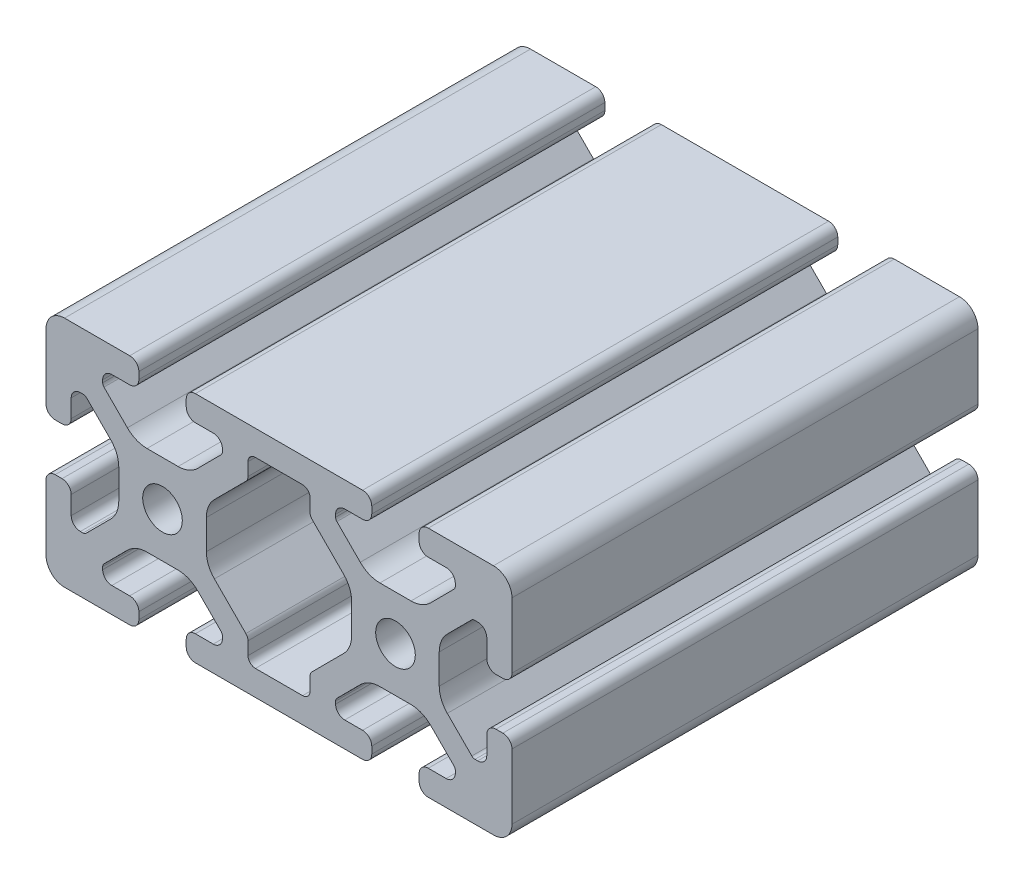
from build123d import *

# Parameters (mm, degrees)
SKETCH1_R      = 3.4
EXTRUDE1_DEPTH = 40


with BuildPart() as part:
    # Sketch1 → Extrude1 (new, symmetric)
    with BuildSketch(Plane.XY):
        with BuildLine():
            Line((15.924472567, -18.442200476), (15.924472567, -17.254670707))
            ThreePointArc((15.924472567, -17.254670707), (15.464630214, -16.14451306), (14.354472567, -15.684670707))
            Line((14.354472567, -15.684670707), (11.285535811, -15.684670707))
            ThreePointArc((11.285535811, -15.684670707), (10.175378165, -15.224828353), (9.715535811, -14.114670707))
            Line((9.715535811, -14.114670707), (9.715535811, -13.671864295))
            ThreePointArc((9.715535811, -13.671864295), (9.773099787, -13.381720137), (9.937071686, -13.13552822))
            Line((9.937071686, -13.13552822), (13.95542212, -9.10123395))
            ThreePointArc((13.95542212, -9.10123395), (15.498733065, -8.06670831), (17.320822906, -7.703334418))
            Line((17.320822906, -7.703334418), (22.66210189, -7.703334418))
            ThreePointArc((22.66210189, -7.703334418), (24.484191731, -8.06670831), (26.027502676, -9.10123395))
            Line((26.027502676, -9.10123395), (30.045853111, -13.13552822))
            ThreePointArc((30.045853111, -13.13552822), (30.209825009, -13.381720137), (30.267388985, -13.671864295))
            Line((30.267388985, -13.671864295), (30.267388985, -14.114670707))
            ThreePointArc((30.267388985, -14.114670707), (29.807546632, -15.224828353), (28.697388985, -15.684670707))
            Line((28.697388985, -15.684670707), (25.628452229, -15.684670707))
            ThreePointArc((25.628452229, -15.684670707), (24.518294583, -16.14451306), (24.058452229, -17.254670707))
            Line((24.058452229, -17.254670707), (24.058452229, -18.442200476))
            ThreePointArc((24.058452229, -18.442200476), (24.518294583, -19.552358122), (25.628452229, -20.012200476))
            Line((25.628452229, -20.012200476), (36.819087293, -20.012200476))
            ThreePointArc((36.819087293, -20.012200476), (39.067686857, -19.08080004), (39.999087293, -16.832200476))
            Line((39.999087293, -16.832200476), (39.999087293, -5.641565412))
            ThreePointArc((39.999087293, -5.641565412), (39.53924494, -4.531407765), (38.429087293, -4.071565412))
            Line((38.429087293, -4.071565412), (37.241557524, -4.071565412))
            ThreePointArc((37.241557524, -4.071565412), (36.131399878, -4.531407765), (35.671557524, -5.641565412))
            Line((35.671557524, -5.641565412), (35.671557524, -8.781441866))
            ThreePointArc((35.671557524, -8.781441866), (35.211715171, -9.891599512), (34.101557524, -10.351441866))
            Line((34.101557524, -10.351441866), (33.646201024, -10.351441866))
            ThreePointArc((33.646201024, -10.351441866), (33.35466665, -10.293302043), (33.107736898, -10.127777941))
            Line((33.107736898, -10.127777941), (28.893335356, -5.89665468))
            ThreePointArc((28.893335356, -5.89665468), (27.868510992, -4.357955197), (27.508736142, -2.544554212))
            Line((27.508736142, -2.544554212), (27.508736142, 2.543848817))
            ThreePointArc((27.508736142, 2.543848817), (27.868510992, 4.357249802), (28.893335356, 5.895949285))
            Line((28.893335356, 5.895949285), (33.049907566, 10.069013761))
            ThreePointArc((33.049907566, 10.069013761), (33.296837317, 10.234537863), (33.588371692, 10.292677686))
            Line((33.588371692, 10.292677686), (34.101557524, 10.292677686))
            ThreePointArc((34.101557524, 10.292677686), (35.211715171, 9.832835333), (35.671557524, 8.722677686))
            Line((35.671557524, 8.722677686), (35.671557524, 5.640860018))
            ThreePointArc((35.671557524, 5.640860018), (36.131399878, 4.530702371), (37.241557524, 4.070860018))
            Line((37.241557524, 4.070860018), (38.429087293, 4.070860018))
            ThreePointArc((38.429087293, 4.070860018), (39.53924494, 4.530702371), (39.999087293, 5.640860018))
            Line((39.999087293, 5.640860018), (39.999087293, 16.831495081))
            ThreePointArc((39.999087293, 16.831495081), (39.067686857, 19.080094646), (36.819087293, 20.011495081))
            Line((36.819087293, 20.011495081), (25.628452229, 20.011495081))
            ThreePointArc((25.628452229, 20.011495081), (24.518294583, 19.551652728), (24.058452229, 18.441495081))
            Line((24.058452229, 18.441495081), (24.058452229, 17.253965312))
            ThreePointArc((24.058452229, 17.253965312), (24.518294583, 16.143807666), (25.628452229, 15.683965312))
            Line((25.628452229, 15.683965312), (28.697388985, 15.683965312))
            ThreePointArc((28.697388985, 15.683965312), (29.807546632, 15.224122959), (30.267388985, 14.113965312))
            Line((30.267388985, 14.113965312), (30.267388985, 13.671158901))
            ThreePointArc((30.267388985, 13.671158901), (30.209825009, 13.381014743), (30.045853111, 13.134822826))
            Line((30.045853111, 13.134822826), (26.027502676, 9.100528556))
            ThreePointArc((26.027502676, 9.100528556), (24.484191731, 8.066002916), (22.66210189, 7.702629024))
            Line((22.66210189, 7.702629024), (17.320822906, 7.702629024))
            ThreePointArc((17.320822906, 7.702629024), (15.498733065, 8.066002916), (13.95542212, 9.100528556))
            Line((13.95542212, 9.100528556), (9.937071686, 13.134822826))
            ThreePointArc((9.937071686, 13.134822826), (9.773099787, 13.381014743), (9.715535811, 13.671158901))
            Line((9.715535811, 13.671158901), (9.715535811, 14.113965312))
            ThreePointArc((9.715535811, 14.113965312), (10.175378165, 15.224122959), (11.285535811, 15.683965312))
            Line((11.285535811, 15.683965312), (14.354472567, 15.683965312))
            ThreePointArc((14.354472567, 15.683965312), (15.464630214, 16.143807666), (15.924472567, 17.253965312))
            Line((15.924472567, 17.253965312), (15.924472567, 18.441495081))
            ThreePointArc((15.924472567, 18.441495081), (15.464630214, 19.551652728), (14.354472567, 20.011495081))
            Line((14.354472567, 20.011495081), (-14.354482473, 20.011495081))
            ThreePointArc((-14.354482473, 20.011495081), (-15.464640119, 19.551652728), (-15.924482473, 18.441495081))
            Line((-15.924482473, 18.441495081), (-15.924482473, 17.253965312))
            ThreePointArc((-15.924482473, 17.253965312), (-15.464640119, 16.143807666), (-14.354482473, 15.683965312))
            Line((-14.354482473, 15.683965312), (-11.285545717, 15.683965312))
            ThreePointArc((-11.285545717, 15.683965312), (-10.17538807, 15.224122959), (-9.715545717, 14.113965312))
            Line((-9.715545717, 14.113965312), (-9.715545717, 13.671158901))
            ThreePointArc((-9.715545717, 13.671158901), (-9.773109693, 13.381014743), (-9.937081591, 13.134822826))
            Line((-9.937081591, 13.134822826), (-13.955432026, 9.100528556))
            ThreePointArc((-13.955432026, 9.100528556), (-15.498742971, 8.066002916), (-17.320832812, 7.702629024))
            Line((-17.320832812, 7.702629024), (-22.662111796, 7.702629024))
            ThreePointArc((-22.662111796, 7.702629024), (-24.484201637, 8.066002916), (-26.027512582, 9.100528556))
            Line((-26.027512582, 9.100528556), (-30.045863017, 13.134822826))
            ThreePointArc((-30.045863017, 13.134822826), (-30.209834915, 13.381014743), (-30.267398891, 13.671158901))
            Line((-30.267398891, 13.671158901), (-30.267398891, 14.113965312))
            ThreePointArc((-30.267398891, 14.113965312), (-29.807556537, 15.224122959), (-28.697398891, 15.683965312))
            Line((-28.697398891, 15.683965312), (-25.628462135, 15.683965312))
            ThreePointArc((-25.628462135, 15.683965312), (-24.518304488, 16.143807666), (-24.058462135, 17.253965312))
            Line((-24.058462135, 17.253965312), (-24.058462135, 18.441495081))
            ThreePointArc((-24.058462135, 18.441495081), (-24.518304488, 19.551652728), (-25.628462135, 20.011495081))
            Line((-25.628462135, 20.011495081), (-36.819097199, 20.011495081))
            ThreePointArc((-36.819097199, 20.011495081), (-39.067696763, 19.080094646), (-39.999097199, 16.831495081))
            Line((-39.999097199, 16.831495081), (-39.999097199, 5.640860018))
            ThreePointArc((-39.999097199, 5.640860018), (-39.539254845, 4.530702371), (-38.429097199, 4.070860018))
            Line((-38.429097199, 4.070860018), (-37.24156743, 4.070860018))
            ThreePointArc((-37.24156743, 4.070860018), (-36.131409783, 4.530702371), (-35.67156743, 5.640860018))
            Line((-35.67156743, 5.640860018), (-35.67156743, 8.722677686))
            ThreePointArc((-35.67156743, 8.722677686), (-35.211725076, 9.832835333), (-34.10156743, 10.292677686))
            Line((-34.10156743, 10.292677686), (-33.588381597, 10.292677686))
            ThreePointArc((-33.588381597, 10.292677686), (-33.296847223, 10.234537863), (-33.049917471, 10.069013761))
            Line((-33.049917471, 10.069013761), (-28.893345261, 5.895949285))
            ThreePointArc((-28.893345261, 5.895949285), (-27.868520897, 4.357249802), (-27.508746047, 2.543848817))
            Line((-27.508746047, 2.543848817), (-27.508746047, -2.544554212))
            ThreePointArc((-27.508746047, -2.544554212), (-27.868520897, -4.357955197), (-28.893345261, -5.89665468))
            Line((-28.893345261, -5.89665468), (-33.107746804, -10.127777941))
            ThreePointArc((-33.107746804, -10.127777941), (-33.354676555, -10.293302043), (-33.64621093, -10.351441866))
            Line((-33.64621093, -10.351441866), (-34.10156743, -10.351441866))
            ThreePointArc((-34.10156743, -10.351441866), (-35.211725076, -9.891599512), (-35.67156743, -8.781441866))
            Line((-35.67156743, -8.781441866), (-35.67156743, -5.641565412))
            ThreePointArc((-35.67156743, -5.641565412), (-36.131409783, -4.531407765), (-37.24156743, -4.071565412))
            Line((-37.24156743, -4.071565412), (-38.429097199, -4.071565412))
            ThreePointArc((-38.429097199, -4.071565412), (-39.539254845, -4.531407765), (-39.999097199, -5.641565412))
            Line((-39.999097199, -5.641565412), (-39.999097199, -16.832200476))
            ThreePointArc((-39.999097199, -16.832200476), (-39.067696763, -19.08080004), (-36.819097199, -20.012200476))
            Line((-36.819097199, -20.012200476), (-25.628462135, -20.012200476))
            ThreePointArc((-25.628462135, -20.012200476), (-24.518304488, -19.552358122), (-24.058462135, -18.442200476))
            Line((-24.058462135, -18.442200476), (-24.058462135, -17.254670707))
            ThreePointArc((-24.058462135, -17.254670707), (-24.518304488, -16.14451306), (-25.628462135, -15.684670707))
            Line((-25.628462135, -15.684670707), (-28.697398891, -15.684670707))
            ThreePointArc((-28.697398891, -15.684670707), (-29.807556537, -15.224828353), (-30.267398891, -14.114670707))
            Line((-30.267398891, -14.114670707), (-30.267398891, -13.671864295))
            ThreePointArc((-30.267398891, -13.671864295), (-30.209834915, -13.381720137), (-30.045863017, -13.13552822))
            Line((-30.045863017, -13.13552822), (-26.027512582, -9.10123395))
            ThreePointArc((-26.027512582, -9.10123395), (-24.484201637, -8.06670831), (-22.662111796, -7.703334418))
            Line((-22.662111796, -7.703334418), (-17.320832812, -7.703334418))
            ThreePointArc((-17.320832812, -7.703334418), (-15.498742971, -8.06670831), (-13.955432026, -9.10123395))
            Line((-13.955432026, -9.10123395), (-9.937081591, -13.13552822))
            ThreePointArc((-9.937081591, -13.13552822), (-9.773109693, -13.381720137), (-9.715545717, -13.671864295))
            Line((-9.715545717, -13.671864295), (-9.715545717, -14.114670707))
            ThreePointArc((-9.715545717, -14.114670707), (-10.17538807, -15.224828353), (-11.285545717, -15.684670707))
            Line((-11.285545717, -15.684670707), (-14.354482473, -15.684670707))
            ThreePointArc((-14.354482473, -15.684670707), (-15.464640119, -16.14451306), (-15.924482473, -17.254670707))
            Line((-15.924482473, -17.254670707), (-15.924482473, -18.442200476))
            ThreePointArc((-15.924482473, -18.442200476), (-15.464640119, -19.552358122), (-14.354482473, -20.012200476))
            Line((-14.354482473, -20.012200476), (14.354472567, -20.012200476))
            ThreePointArc((14.354472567, -20.012200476), (15.464630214, -19.552358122), (15.924472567, -18.442200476))
        make_face()
        with Locations((20, 0)):
            Circle(SKETCH1_R, mode=Mode.SUBTRACT)
        with Locations((-20, 0)):
            Circle(SKETCH1_R, mode=Mode.SUBTRACT)
        with BuildLine():
            Line((-11.089599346, -5.89665468), (-5.690521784, -11.317154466))
            ThreePointArc((-5.690521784, -11.317154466), (-5.416516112, -11.728554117), (-5.320323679, -12.213400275))
            Line((-5.320323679, -12.213400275), (-5.320323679, -14.414670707))
            ThreePointArc((-5.320323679, -14.414670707), (-4.948349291, -15.312696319), (-4.050323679, -15.684670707))
            Line((-4.050323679, -15.684670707), (4.050313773, -15.684670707))
            ThreePointArc((4.050313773, -15.684670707), (4.948339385, -15.312696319), (5.320313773, -14.414670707))
            Line((5.320313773, -14.414670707), (5.320313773, -12.213400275))
            ThreePointArc((5.320313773, -12.213400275), (5.416506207, -11.728554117), (5.690511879, -11.317154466))
            Line((5.690511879, -11.317154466), (11.089589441, -5.89665468))
            ThreePointArc((11.089589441, -5.89665468), (12.114413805, -4.357955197), (12.474188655, -2.544554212))
            Line((12.474188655, -2.544554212), (12.474188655, 2.543848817))
            ThreePointArc((12.474188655, 2.543848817), (12.114413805, 4.357249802), (11.089589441, 5.895949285))
            Line((11.089589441, 5.895949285), (5.690511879, 11.316449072))
            ThreePointArc((5.690511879, 11.316449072), (5.416506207, 11.727848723), (5.320313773, 12.212694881))
            Line((5.320313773, 12.212694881), (5.320313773, 14.413965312))
            ThreePointArc((5.320313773, 14.413965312), (4.948339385, 15.311990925), (4.050313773, 15.683965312))
            Line((4.050313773, 15.683965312), (-4.050323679, 15.683965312))
            ThreePointArc((-4.050323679, 15.683965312), (-4.948349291, 15.311990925), (-5.320323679, 14.413965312))
            Line((-5.320323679, 14.413965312), (-5.320323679, 12.212694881))
            ThreePointArc((-5.320323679, 12.212694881), (-5.416516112, 11.727848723), (-5.690521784, 11.316449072))
            Line((-5.690521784, 11.316449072), (-11.089599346, 5.895949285))
            ThreePointArc((-11.089599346, 5.895949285), (-12.11442371, 4.357249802), (-12.47419856, 2.543848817))
            Line((-12.47419856, 2.543848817), (-12.47419856, -2.544554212))
            ThreePointArc((-12.47419856, -2.544554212), (-12.11442371, -4.357955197), (-11.089599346, -5.89665468))
        make_face(mode=Mode.SUBTRACT)
    extrude(amount=EXTRUDE1_DEPTH, both=True)


solid = part.part
